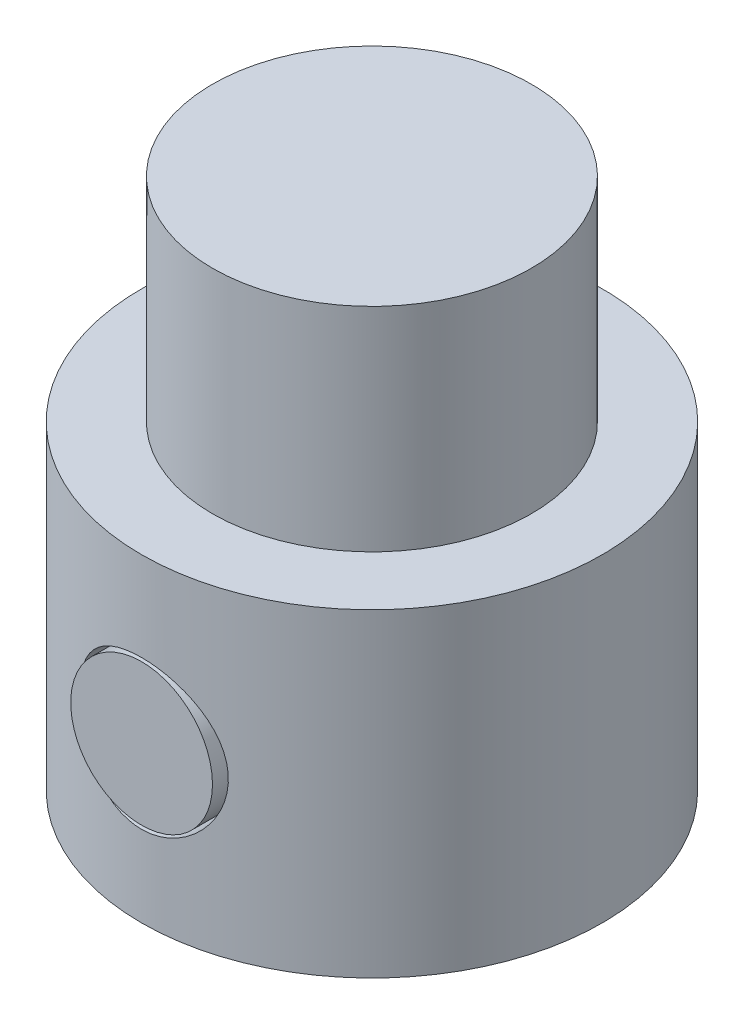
ISO-10303-21;
HEADER;
FILE_DESCRIPTION(('STEP AP214'),'2;1');
FILE_NAME('part.step','',(''),(''),'','','');
FILE_SCHEMA(('AUTOMOTIVE_DESIGN { 1 0 10303 214 1 1 1 1 }'));
ENDSEC;
DATA;
#1=APPLICATION_CONTEXT('core data for automotive mechanical design processes');
#2=APPLICATION_PROTOCOL_DEFINITION('international standard','automotive_design',2000,#1);
#3=PRODUCT_CONTEXT('',#1,'mechanical');
#4=PRODUCT('Part','Part','',(#3));
#5=PRODUCT_RELATED_PRODUCT_CATEGORY('part','',(#4));
#6=PRODUCT_DEFINITION_FORMATION('','',#4);
#7=PRODUCT_DEFINITION_CONTEXT('part definition',#1,'design');
#8=PRODUCT_DEFINITION('design','',#6,#7);
#9=PRODUCT_DEFINITION_SHAPE('','',#8);
#10=(LENGTH_UNIT() NAMED_UNIT(*) SI_UNIT(.MILLI.,.METRE.));
#11=(NAMED_UNIT(*) PLANE_ANGLE_UNIT() SI_UNIT($,.RADIAN.));
#12=(NAMED_UNIT(*) SI_UNIT($,.STERADIAN.) SOLID_ANGLE_UNIT());
#13=UNCERTAINTY_MEASURE_WITH_UNIT(LENGTH_MEASURE(1.E-05),#10,'distance_accuracy_value','');
#14=(GEOMETRIC_REPRESENTATION_CONTEXT(3) GLOBAL_UNCERTAINTY_ASSIGNED_CONTEXT((#13)) GLOBAL_UNIT_ASSIGNED_CONTEXT((#10,
#11,#12)) REPRESENTATION_CONTEXT('',''));
#15=CARTESIAN_POINT('',(0.,0.,0.));
#16=DIRECTION('',(0.,0.,1.));
#17=DIRECTION('',(1.,0.,0.));
#18=AXIS2_PLACEMENT_3D('',#15,#16,#17);
#19=CARTESIAN_POINT('',(0.,8.9999999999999,0.));
#20=DIRECTION('',(0.,-1.,0.));
#21=DIRECTION('',(0.,0.,-1.));
#22=AXIS2_PLACEMENT_3D('',#19,#20,#21);
#23=CYLINDRICAL_SURFACE('',#22,6.5);
#24=CARTESIAN_POINT('',(0.,8.9999999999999,0.));
#25=DIRECTION('',(0.,1.,0.));
#26=DIRECTION('',(0.,0.,1.));
#27=AXIS2_PLACEMENT_3D('',#24,#25,#26);
#28=CIRCLE('',#27,6.5);
#29=CARTESIAN_POINT('',(0.,8.9999999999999,6.5));
#30=VERTEX_POINT('',#29);
#31=EDGE_CURVE('E56',#30,#30,#28,.T.);
#32=ORIENTED_EDGE('',*,*,#31,.F.);
#33=EDGE_LOOP('',(#32));
#34=FACE_BOUND('',#33,.T.);
#35=CARTESIAN_POINT('',(0.,0.,0.));
#36=DIRECTION('',(0.,1.,0.));
#37=DIRECTION('',(0.,0.,1.));
#38=AXIS2_PLACEMENT_3D('',#35,#36,#37);
#39=CIRCLE('',#38,6.5);
#40=CARTESIAN_POINT('',(0.,0.,6.5));
#41=VERTEX_POINT('',#40);
#42=EDGE_CURVE('E61',#41,#41,#39,.T.);
#43=ORIENTED_EDGE('',*,*,#42,.T.);
#44=EDGE_LOOP('',(#43));
#45=FACE_BOUND('',#44,.T.);
#46=CARTESIAN_POINT('',(-2.09999999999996,4.38808987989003,6.15142259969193));
#47=CARTESIAN_POINT('',(-2.09999985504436,4.27348635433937,6.15142280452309));
#48=CARTESIAN_POINT('',(-2.09058680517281,4.15888049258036,6.15466029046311));
#49=CARTESIAN_POINT('',(-2.05330060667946,3.93304995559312,6.16719821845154));
#50=CARTESIAN_POINT('',(-2.02542346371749,3.82182601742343,6.17649997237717));
#51=CARTESIAN_POINT('',(-1.9522790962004,3.60606505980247,6.20000528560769));
#52=CARTESIAN_POINT('',(-1.9070442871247,3.50151599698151,6.21419970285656));
#53=CARTESIAN_POINT('',(-1.80057810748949,3.30145921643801,6.24587799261));
#54=CARTESIAN_POINT('',(-1.73934355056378,3.20595330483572,6.26336252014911));
#55=CARTESIAN_POINT('',(-1.60020683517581,3.02318555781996,6.30037131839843));
#56=CARTESIAN_POINT('',(-1.5218171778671,2.9363045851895,6.3199441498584));
#57=CARTESIAN_POINT('',(-1.35163723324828,2.77666448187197,6.35851237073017));
#58=CARTESIAN_POINT('',(-1.25984494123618,2.70390746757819,6.37750767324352));
#59=CARTESIAN_POINT('',(-1.06270432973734,2.5728762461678,6.41333944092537));
#60=CARTESIAN_POINT('',(-0.957080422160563,2.51499768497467,6.43011210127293));
#61=CARTESIAN_POINT('',(-0.736962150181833,2.4179777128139,6.45903914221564));
#62=CARTESIAN_POINT('',(-0.622470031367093,2.37883157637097,6.47119468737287));
#63=CARTESIAN_POINT('',(-0.391855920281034,2.3216692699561,6.48917405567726));
#64=CARTESIAN_POINT('',(-0.275910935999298,2.30300139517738,6.49519270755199));
#65=CARTESIAN_POINT('',(-0.0423886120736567,2.28525699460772,6.50090999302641));
#66=CARTESIAN_POINT('',(0.0751883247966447,2.28617571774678,6.50061015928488));
#67=CARTESIAN_POINT('',(0.30403717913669,2.30715738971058,6.49385810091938));
#68=CARTESIAN_POINT('',(0.415381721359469,2.32651318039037,6.48763314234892));
#69=CARTESIAN_POINT('',(0.633147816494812,2.38265467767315,6.47001270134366));
#70=CARTESIAN_POINT('',(0.739569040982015,2.41944154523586,6.45861687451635));
#71=CARTESIAN_POINT('',(0.946056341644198,2.50983437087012,6.4316379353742));
#72=CARTESIAN_POINT('',(1.04602442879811,2.56364819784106,6.41600343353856));
#73=CARTESIAN_POINT('',(1.23572596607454,2.68639839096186,6.38218452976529));
#74=CARTESIAN_POINT('',(1.32545668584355,2.75533877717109,6.36399945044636));
#75=CARTESIAN_POINT('',(1.49634844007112,2.90998247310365,6.32605299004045));
#76=CARTESIAN_POINT('',(1.57695224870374,2.99629404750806,6.30625747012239));
#77=CARTESIAN_POINT('',(1.72271467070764,3.1813864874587,6.26800983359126));
#78=CARTESIAN_POINT('',(1.78787119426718,3.28016903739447,6.24955789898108));
#79=CARTESIAN_POINT('',(1.90159856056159,3.48906901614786,6.21590694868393));
#80=CARTESIAN_POINT('',(1.94994873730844,3.59931423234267,6.20075212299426));
#81=CARTESIAN_POINT('',(2.02721623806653,3.82699191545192,6.17592589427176));
#82=CARTESIAN_POINT('',(2.05614111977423,3.94442156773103,6.16625235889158));
#83=CARTESIAN_POINT('',(2.09263228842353,4.17776619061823,6.15396191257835));
#84=CARTESIAN_POINT('',(2.10105724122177,4.29353200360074,6.15106152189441));
#85=CARTESIAN_POINT('',(2.0987308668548,4.52483601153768,6.15185601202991));
#86=CARTESIAN_POINT('',(2.08798275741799,4.64037424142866,6.15554978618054));
#87=CARTESIAN_POINT('',(2.04838489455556,4.86414295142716,6.16883514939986));
#88=CARTESIAN_POINT('',(2.02011766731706,4.97248898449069,6.17823675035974));
#89=CARTESIAN_POINT('',(1.94697541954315,5.18288345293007,6.20167328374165));
#90=CARTESIAN_POINT('',(1.90209756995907,5.28493081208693,6.21570900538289));
#91=CARTESIAN_POINT('',(1.79546296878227,5.48324729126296,6.24735835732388));
#92=CARTESIAN_POINT('',(1.73323700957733,5.57924850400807,6.26506731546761));
#93=CARTESIAN_POINT('',(1.59421223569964,5.75975811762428,6.30187668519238));
#94=CARTESIAN_POINT('',(1.51740937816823,5.84426331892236,6.32097748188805));
#95=CARTESIAN_POINT('',(1.34732599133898,6.0032869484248,6.35945250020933));
#96=CARTESIAN_POINT('',(1.25346188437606,6.07718923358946,6.37880070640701));
#97=CARTESIAN_POINT('',(1.05419225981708,6.20822582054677,6.41474189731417));
#98=CARTESIAN_POINT('',(0.948787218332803,6.26536081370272,6.43133499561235));
#99=CARTESIAN_POINT('',(0.730020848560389,6.36070261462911,6.45980941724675));
#100=CARTESIAN_POINT('',(0.616721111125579,6.39904052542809,6.47172325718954));
#101=CARTESIAN_POINT('',(0.384825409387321,6.45597541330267,6.48963873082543));
#102=CARTESIAN_POINT('',(0.266231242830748,6.47457903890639,6.49564235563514));
#103=CARTESIAN_POINT('',(0.0327663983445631,6.49094769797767,6.50091978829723));
#104=CARTESIAN_POINT('',(-0.0820363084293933,6.48959988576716,6.50048011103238));
#105=CARTESIAN_POINT('',(-0.309704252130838,6.46827083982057,6.4936162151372));
#106=CARTESIAN_POINT('',(-0.422569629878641,6.44829096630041,6.48719243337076));
#107=CARTESIAN_POINT('',(-0.641578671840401,6.39084225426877,6.46918014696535));
#108=CARTESIAN_POINT('',(-0.747794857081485,6.35362492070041,6.45766601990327));
#109=CARTESIAN_POINT('',(-0.952521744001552,6.2629875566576,6.43065906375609));
#110=CARTESIAN_POINT('',(-1.05103108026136,6.20956466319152,6.4151655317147));
#111=CARTESIAN_POINT('',(-1.24135560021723,6.08584498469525,6.38112202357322));
#112=CARTESIAN_POINT('',(-1.332809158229,6.01501665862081,6.36248309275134));
#113=CARTESIAN_POINT('',(-1.50282496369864,5.85941730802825,6.32448577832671));
#114=CARTESIAN_POINT('',(-1.58138321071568,5.77464197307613,6.30512717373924));
#115=CARTESIAN_POINT('',(-1.72625190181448,5.58988996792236,6.26704677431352));
#116=CARTESIAN_POINT('',(-1.79201760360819,5.48947489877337,6.24837322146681));
#117=CARTESIAN_POINT('',(-1.90568035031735,5.2784452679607,6.21465329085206));
#118=CARTESIAN_POINT('',(-1.95358337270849,5.16783413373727,6.19960570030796));
#119=CARTESIAN_POINT('',(-2.02739685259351,4.94694864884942,6.17584589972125));
#120=CARTESIAN_POINT('',(-2.05453849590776,4.83712336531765,6.16678433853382));
#121=CARTESIAN_POINT('',(-2.09083750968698,4.61422879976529,6.15457345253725));
#122=CARTESIAN_POINT('',(-2.10000014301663,4.50116047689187,6.15142239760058));
#123=CARTESIAN_POINT('',(-2.09999999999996,4.38808987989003,6.15142259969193));
#124=B_SPLINE_CURVE_WITH_KNOTS('',3,(#46,#47,#48,#49,#50,#51,#52,#53,#54,#55,#56,#57,#58,#59,
#60,#61,#62,#63,#64,#65,#66,#67,#68,#69,#70,#71,#72,#73,#74,#75,#76,#77,#78,#79,#80,#81,#82,#83,
#84,#85,#86,#87,#88,#89,#90,#91,#92,#93,#94,#95,#96,#97,#98,#99,#100,#101,#102,#103,#104,#105,
#106,#107,#108,#109,#110,#111,#112,#113,#114,#115,#116,#117,#118,#119,#120,#121,#122,#123),
.UNSPECIFIED.,.T.,.F.,(4,2,2,2,2,2,2,2,2,2,2,2,2,2,2,2,2,2,2,2,2,2,2,2,2,2,2,2,2,2,2,2,2,2,2,2,
2,2,4),(0.,0.343392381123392,0.686859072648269,1.02968743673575,1.3725841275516,
1.72690936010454,2.0812876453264,2.44429209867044,2.80720493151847,3.15819942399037,
3.50910877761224,3.84707897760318,4.18507169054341,4.52736116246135,4.86974171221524,
5.22732065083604,5.58494793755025,5.94710765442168,6.30912638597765,6.65569856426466,
7.0022125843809,7.33778079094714,7.67340617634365,8.01917681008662,8.365043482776,
8.72638784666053,9.0877173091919,9.44648944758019,9.80514067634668,10.1478940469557,
10.4906223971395,10.8285004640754,11.1664382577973,11.5163688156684,11.8664077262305,
12.2290873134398,12.5916454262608,12.9305438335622,13.2693430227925),.UNSPECIFIED.);
#125=CARTESIAN_POINT('',(-2.09999999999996,4.38808987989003,6.15142259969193));
#126=VERTEX_POINT('',#125);
#127=EDGE_CURVE('E48',#126,#126,#124,.T.);
#128=ORIENTED_EDGE('',*,*,#127,.F.);
#129=EDGE_LOOP('',(#128));
#130=FACE_BOUND('',#129,.T.);
#131=ADVANCED_FACE('F44',(#34,#45,#130),#23,.T.);
#132=CARTESIAN_POINT('',(0.,8.9999999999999,0.));
#133=DIRECTION('',(0.,1.,0.));
#134=DIRECTION('',(0.,0.,1.));
#135=AXIS2_PLACEMENT_3D('',#132,#133,#134);
#136=PLANE('',#135);
#137=CARTESIAN_POINT('',(0.,8.9999999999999,0.));
#138=DIRECTION('',(0.,1.,0.));
#139=DIRECTION('',(0.,0.,1.));
#140=AXIS2_PLACEMENT_3D('',#137,#138,#139);
#141=CIRCLE('',#140,4.5);
#142=CARTESIAN_POINT('',(0.,8.9999999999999,4.5));
#143=VERTEX_POINT('',#142);
#144=EDGE_CURVE('E12',#143,#143,#141,.T.);
#145=ORIENTED_EDGE('',*,*,#144,.F.);
#146=EDGE_LOOP('',(#145));
#147=FACE_BOUND('',#146,.T.);
#148=ORIENTED_EDGE('',*,*,#31,.T.);
#149=EDGE_LOOP('',(#148));
#150=FACE_BOUND('',#149,.T.);
#151=ADVANCED_FACE('F103',(#147,#150),#136,.T.);
#152=CARTESIAN_POINT('',(0.,0.,0.));
#153=DIRECTION('',(0.,1.,0.));
#154=DIRECTION('',(0.,0.,1.));
#155=AXIS2_PLACEMENT_3D('',#152,#153,#154);
#156=PLANE('',#155);
#157=ORIENTED_EDGE('',*,*,#42,.F.);
#158=EDGE_LOOP('',(#157));
#159=FACE_BOUND('',#158,.T.);
#160=ADVANCED_FACE('F108',(#159),#156,.F.);
#161=CARTESIAN_POINT('',(0.,14.9999999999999,0.));
#162=DIRECTION('',(0.,-1.,0.));
#163=DIRECTION('',(0.,0.,-1.));
#164=AXIS2_PLACEMENT_3D('',#161,#162,#163);
#165=CYLINDRICAL_SURFACE('',#164,4.5);
#166=CARTESIAN_POINT('',(0.,14.9999999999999,0.));
#167=DIRECTION('',(0.,1.,0.));
#168=DIRECTION('',(0.,0.,1.));
#169=AXIS2_PLACEMENT_3D('',#166,#167,#168);
#170=CIRCLE('',#169,4.5);
#171=CARTESIAN_POINT('',(0.,14.9999999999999,4.50000000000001));
#172=VERTEX_POINT('',#171);
#173=EDGE_CURVE('E64',#172,#172,#170,.T.);
#174=ORIENTED_EDGE('',*,*,#173,.F.);
#175=EDGE_LOOP('',(#174));
#176=FACE_BOUND('',#175,.T.);
#177=ORIENTED_EDGE('',*,*,#144,.T.);
#178=EDGE_LOOP('',(#177));
#179=FACE_BOUND('',#178,.T.);
#180=ADVANCED_FACE('F117',(#176,#179),#165,.T.);
#181=CARTESIAN_POINT('',(0.,14.9999999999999,0.));
#182=DIRECTION('',(0.,1.,0.));
#183=DIRECTION('',(0.,0.,1.));
#184=AXIS2_PLACEMENT_3D('',#181,#182,#183);
#185=PLANE('',#184);
#186=ORIENTED_EDGE('',*,*,#173,.T.);
#187=EDGE_LOOP('',(#186));
#188=FACE_BOUND('',#187,.T.);
#189=ADVANCED_FACE('F100',(#188),#185,.T.);
#190=CARTESIAN_POINT('',(0.,4.38808987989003,9.));
#191=DIRECTION('',(0.,0.,-1.));
#192=DIRECTION('',(-1.,0.,0.));
#193=AXIS2_PLACEMENT_3D('',#190,#191,#192);
#194=CYLINDRICAL_SURFACE('',#193,2.1);
#195=CARTESIAN_POINT('',(0.,4.38808987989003,0.));
#196=DIRECTION('',(0.,0.,1.));
#197=DIRECTION('',(1.,0.,0.));
#198=AXIS2_PLACEMENT_3D('',#195,#196,#197);
#199=CIRCLE('',#198,2.1);
#200=CARTESIAN_POINT('',(2.1,4.38808987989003,0.));
#201=VERTEX_POINT('',#200);
#202=EDGE_CURVE('E73',#201,#201,#199,.T.);
#203=ORIENTED_EDGE('',*,*,#202,.F.);
#204=EDGE_LOOP('',(#203));
#205=FACE_BOUND('',#204,.T.);
#206=ORIENTED_EDGE('',*,*,#127,.T.);
#207=EDGE_LOOP('',(#206));
#208=FACE_BOUND('',#207,.T.);
#209=ADVANCED_FACE('F91',(#205,#208),#194,.F.);
#210=CARTESIAN_POINT('',(0.,4.38808987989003,0.));
#211=DIRECTION('',(0.,0.,1.));
#212=DIRECTION('',(1.,0.,0.));
#213=AXIS2_PLACEMENT_3D('',#210,#211,#212);
#214=PLANE('',#213);
#215=CARTESIAN_POINT('',(0.,4.38808987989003,0.));
#216=DIRECTION('',(0.,0.,1.));
#217=DIRECTION('',(1.,0.,0.));
#218=AXIS2_PLACEMENT_3D('',#215,#216,#217);
#219=CIRCLE('',#218,2.);
#220=CARTESIAN_POINT('',(2.,4.38808987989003,0.));
#221=VERTEX_POINT('',#220);
#222=EDGE_CURVE('E81',#221,#221,#219,.T.);
#223=ORIENTED_EDGE('',*,*,#222,.F.);
#224=EDGE_LOOP('',(#223));
#225=FACE_BOUND('',#224,.T.);
#226=ORIENTED_EDGE('',*,*,#202,.T.);
#227=EDGE_LOOP('',(#226));
#228=FACE_BOUND('',#227,.T.);
#229=ADVANCED_FACE('F89',(#225,#228),#214,.T.);
#230=CARTESIAN_POINT('',(0.,4.38808987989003,6.50000000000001));
#231=DIRECTION('',(0.,0.,-1.));
#232=DIRECTION('',(-1.,0.,0.));
#233=AXIS2_PLACEMENT_3D('',#230,#231,#232);
#234=CYLINDRICAL_SURFACE('',#233,2.);
#235=CARTESIAN_POINT('',(0.,4.38808987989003,6.50000000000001));
#236=DIRECTION('',(0.,0.,1.));
#237=DIRECTION('',(1.,0.,0.));
#238=AXIS2_PLACEMENT_3D('',#235,#236,#237);
#239=CIRCLE('',#238,2.);
#240=CARTESIAN_POINT('',(2.00000000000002,4.38808987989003,6.50000000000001));
#241=VERTEX_POINT('',#240);
#242=EDGE_CURVE('E77',#241,#241,#239,.T.);
#243=ORIENTED_EDGE('',*,*,#242,.F.);
#244=EDGE_LOOP('',(#243));
#245=FACE_BOUND('',#244,.T.);
#246=ORIENTED_EDGE('',*,*,#222,.T.);
#247=EDGE_LOOP('',(#246));
#248=FACE_BOUND('',#247,.T.);
#249=ADVANCED_FACE('F87',(#245,#248),#234,.T.);
#250=CARTESIAN_POINT('',(0.,4.38808987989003,6.50000000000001));
#251=DIRECTION('',(0.,0.,1.));
#252=DIRECTION('',(1.,0.,0.));
#253=AXIS2_PLACEMENT_3D('',#250,#251,#252);
#254=PLANE('',#253);
#255=ORIENTED_EDGE('',*,*,#242,.T.);
#256=EDGE_LOOP('',(#255));
#257=FACE_BOUND('',#256,.T.);
#258=ADVANCED_FACE('F97',(#257),#254,.T.);
#259=CLOSED_SHELL('',(#131,#151,#160,#180,#189,#209,#229,#249,#258));
#260=MANIFOLD_SOLID_BREP('B2',#259);
#261=ADVANCED_BREP_SHAPE_REPRESENTATION('',(#18,#260),#14);
#262=SHAPE_DEFINITION_REPRESENTATION(#9,#261);
ENDSEC;
END-ISO-10303-21;
